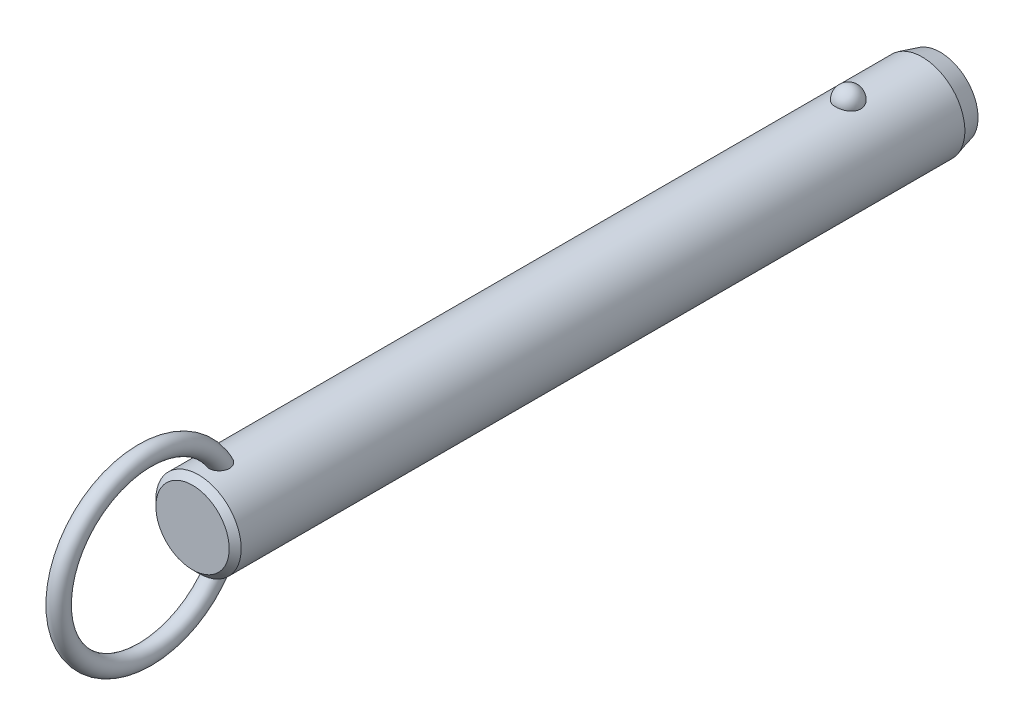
ISO-10303-21;
HEADER;
FILE_DESCRIPTION(('STEP AP214'),'2;1');
FILE_NAME('part.step','',(''),(''),'','','');
FILE_SCHEMA(('AUTOMOTIVE_DESIGN { 1 0 10303 214 1 1 1 1 }'));
ENDSEC;
DATA;
#1=APPLICATION_CONTEXT('core data for automotive mechanical design processes');
#2=APPLICATION_PROTOCOL_DEFINITION('international standard','automotive_design',2000,#1);
#3=PRODUCT_CONTEXT('',#1,'mechanical');
#4=PRODUCT('Part','Part','',(#3));
#5=PRODUCT_RELATED_PRODUCT_CATEGORY('part','',(#4));
#6=PRODUCT_DEFINITION_FORMATION('','',#4);
#7=PRODUCT_DEFINITION_CONTEXT('part definition',#1,'design');
#8=PRODUCT_DEFINITION('design','',#6,#7);
#9=PRODUCT_DEFINITION_SHAPE('','',#8);
#10=(LENGTH_UNIT() NAMED_UNIT(*) SI_UNIT(.MILLI.,.METRE.));
#11=(NAMED_UNIT(*) PLANE_ANGLE_UNIT() SI_UNIT($,.RADIAN.));
#12=(NAMED_UNIT(*) SI_UNIT($,.STERADIAN.) SOLID_ANGLE_UNIT());
#13=UNCERTAINTY_MEASURE_WITH_UNIT(LENGTH_MEASURE(1.E-05),#10,'distance_accuracy_value','');
#14=(GEOMETRIC_REPRESENTATION_CONTEXT(3) GLOBAL_UNCERTAINTY_ASSIGNED_CONTEXT((#13)) GLOBAL_UNIT_ASSIGNED_CONTEXT((#10,
#11,#12)) REPRESENTATION_CONTEXT('',''));
#15=CARTESIAN_POINT('',(0.,0.,0.));
#16=DIRECTION('',(0.,0.,1.));
#17=DIRECTION('',(1.,0.,0.));
#18=AXIS2_PLACEMENT_3D('',#15,#16,#17);
#19=CARTESIAN_POINT('',(0.,0.,99.1));
#20=DIRECTION('',(0.,0.,-1.));
#21=DIRECTION('',(-1.,0.,0.));
#22=AXIS2_PLACEMENT_3D('',#19,#20,#21);
#23=CYLINDRICAL_SURFACE('',#22,7.1);
#24=CARTESIAN_POINT('',(2.0769088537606,6.78943661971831,-2.1));
#25=CARTESIAN_POINT('',(2.07690739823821,6.78943796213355,-1.98268154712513));
#26=CARTESIAN_POINT('',(2.06738130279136,6.79237331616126,-1.86534506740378));
#27=CARTESIAN_POINT('',(2.0295040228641,6.8037853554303,-1.63400788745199));
#28=CARTESIAN_POINT('',(2.00114757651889,6.81226358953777,-1.52000812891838));
#29=CARTESIAN_POINT('',(1.92632025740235,6.83379798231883,-1.29863433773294));
#30=CARTESIAN_POINT('',(1.87985726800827,6.84685214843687,-1.19125744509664));
#31=CARTESIAN_POINT('',(1.76995205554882,6.87608091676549,-0.98604657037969));
#32=CARTESIAN_POINT('',(1.70650980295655,6.8922555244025,-0.88821260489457));
#33=CARTESIAN_POINT('',(1.5638119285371,6.92602930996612,-0.704242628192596));
#34=CARTESIAN_POINT('',(1.4844714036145,6.94363582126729,-0.618173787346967));
#35=CARTESIAN_POINT('',(1.31221746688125,6.97823658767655,-0.460740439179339));
#36=CARTESIAN_POINT('',(1.21930409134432,6.99523084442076,-0.389375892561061));
#37=CARTESIAN_POINT('',(1.02268781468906,7.02666176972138,-0.263547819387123));
#38=CARTESIAN_POINT('',(0.91902009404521,7.04110638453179,-0.209031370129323));
#39=CARTESIAN_POINT('',(0.703548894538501,7.06588726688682,-0.118163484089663));
#40=CARTESIAN_POINT('',(0.591746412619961,7.07622403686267,-0.0818098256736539));
#41=CARTESIAN_POINT('',(0.365557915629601,7.09147068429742,-0.0288711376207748));
#42=CARTESIAN_POINT('',(0.251267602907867,7.09648447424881,-0.0119070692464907));
#43=CARTESIAN_POINT('',(0.0213499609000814,7.10089837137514,0.00304925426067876));
#44=CARTESIAN_POINT('',(-0.0942772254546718,7.10029907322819,0.00104351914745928));
#45=CARTESIAN_POINT('',(-0.321651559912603,7.09360829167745,-0.0216931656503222));
#46=CARTESIAN_POINT('',(-0.433431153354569,7.08760388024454,-0.0421272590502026));
#47=CARTESIAN_POINT('',(-0.651862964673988,7.07086131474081,-0.100729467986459));
#48=CARTESIAN_POINT('',(-0.758515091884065,7.06012307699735,-0.138897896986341));
#49=CARTESIAN_POINT('',(-0.964449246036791,7.03496097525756,-0.232213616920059));
#50=CARTESIAN_POINT('',(-1.06368095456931,7.02051445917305,-0.287465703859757));
#51=CARTESIAN_POINT('',(-1.25145353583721,6.98948740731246,-0.413383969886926));
#52=CARTESIAN_POINT('',(-1.33999321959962,6.97290663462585,-0.48405186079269));
#53=CARTESIAN_POINT('',(-1.50591604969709,6.93898770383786,-0.640594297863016));
#54=CARTESIAN_POINT('',(-1.58302488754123,6.92164094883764,-0.726757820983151));
#55=CARTESIAN_POINT('',(-1.72189320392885,6.8884103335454,-0.91092752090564));
#56=CARTESIAN_POINT('',(-1.78365144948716,6.87252659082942,-1.008934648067));
#57=CARTESIAN_POINT('',(-1.89101272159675,6.84377189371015,-1.21549497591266));
#58=CARTESIAN_POINT('',(-1.93639553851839,6.83094274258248,-1.32416860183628));
#59=CARTESIAN_POINT('',(-2.00874275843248,6.81002070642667,-1.54791500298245));
#60=CARTESIAN_POINT('',(-2.03570774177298,6.80192767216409,-1.66298757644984));
#61=CARTESIAN_POINT('',(-2.07047276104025,6.7914266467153,-1.89571453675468));
#62=CARTESIAN_POINT('',(-2.07835878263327,6.78899315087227,-2.01335491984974));
#63=CARTESIAN_POINT('',(-2.07502083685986,6.79001409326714,-2.24833570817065));
#64=CARTESIAN_POINT('',(-2.06379746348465,6.7934683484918,-2.36567612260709));
#65=CARTESIAN_POINT('',(-2.02263913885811,6.80583442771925,-2.59603194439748));
#66=CARTESIAN_POINT('',(-1.99281127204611,6.81471501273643,-2.70906820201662));
#67=CARTESIAN_POINT('',(-1.91526639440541,6.83691232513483,-2.92836575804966));
#68=CARTESIAN_POINT('',(-1.8675486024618,6.85022924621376,-3.03462676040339));
#69=CARTESIAN_POINT('',(-1.75504492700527,6.87991336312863,-3.23806487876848));
#70=CARTESIAN_POINT('',(-1.69015924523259,6.89629822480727,-3.33518422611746));
#71=CARTESIAN_POINT('',(-1.54505404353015,6.93024852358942,-3.51697105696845));
#72=CARTESIAN_POINT('',(-1.46483385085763,6.94781401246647,-3.60163799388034));
#73=CARTESIAN_POINT('',(-1.29071406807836,6.98225977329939,-3.75654119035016));
#74=CARTESIAN_POINT('',(-1.19675650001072,6.99913673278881,-3.82671308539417));
#75=CARTESIAN_POINT('',(-0.997940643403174,7.03023618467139,-3.9501837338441));
#76=CARTESIAN_POINT('',(-0.89308318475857,7.04445887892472,-4.00348377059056));
#77=CARTESIAN_POINT('',(-0.676902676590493,7.06848365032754,-4.09107242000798));
#78=CARTESIAN_POINT('',(-0.565686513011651,7.0783430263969,-4.12560889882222));
#79=CARTESIAN_POINT('',(-0.338739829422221,7.09282534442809,-4.17575450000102));
#80=CARTESIAN_POINT('',(-0.223009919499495,7.09744899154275,-4.19136617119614));
#81=CARTESIAN_POINT('',(0.00707628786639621,7.10090930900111,-4.20307965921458));
#82=CARTESIAN_POINT('',(0.121410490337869,7.09986531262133,-4.19958377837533));
#83=CARTESIAN_POINT('',(0.347815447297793,7.092380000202,-4.17411564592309));
#84=CARTESIAN_POINT('',(0.459886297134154,7.08593891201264,-4.15214417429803));
#85=CARTESIAN_POINT('',(0.678084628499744,7.06838983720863,-4.09049562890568));
#86=CARTESIAN_POINT('',(0.784237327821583,7.05730369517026,-4.05090137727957));
#87=CARTESIAN_POINT('',(0.988305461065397,7.03163139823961,-3.95511447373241));
#88=CARTESIAN_POINT('',(1.08622031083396,7.01704499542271,-3.89892064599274));
#89=CARTESIAN_POINT('',(1.27284490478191,6.98562668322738,-3.77035541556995));
#90=CARTESIAN_POINT('',(1.36137372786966,6.96876135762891,-3.69772964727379));
#91=CARTESIAN_POINT('',(1.52509486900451,6.93477412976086,-3.53878279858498));
#92=CARTESIAN_POINT('',(1.60028496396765,6.91765218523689,-3.45245943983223));
#93=CARTESIAN_POINT('',(1.73681688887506,6.88465753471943,-3.26658774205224));
#94=CARTESIAN_POINT('',(1.79785966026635,6.86881574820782,-3.16681408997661));
#95=CARTESIAN_POINT('',(1.90265327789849,6.84053157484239,-2.95814408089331));
#96=CARTESIAN_POINT('',(1.94640861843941,6.82808830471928,-2.84925010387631));
#97=CARTESIAN_POINT('',(2.01274378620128,6.80881460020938,-2.63454318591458));
#98=CARTESIAN_POINT('',(2.03676193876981,6.80160856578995,-2.52920574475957));
#99=CARTESIAN_POINT('',(2.06884490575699,6.79191902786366,-2.3159172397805));
#100=CARTESIAN_POINT('',(2.07691019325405,6.78943538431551,-2.20796625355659));
#101=CARTESIAN_POINT('',(2.0769088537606,6.78943661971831,-2.1));
#102=B_SPLINE_CURVE_WITH_KNOTS('',3,(#24,#25,#26,#27,#28,#29,#30,#31,#32,#33,#34,#35,#36,#37,
#38,#39,#40,#41,#42,#43,#44,#45,#46,#47,#48,#49,#50,#51,#52,#53,#54,#55,#56,#57,#58,#59,#60,#61,
#62,#63,#64,#65,#66,#67,#68,#69,#70,#71,#72,#73,#74,#75,#76,#77,#78,#79,#80,#81,#82,#83,#84,#85,
#86,#87,#88,#89,#90,#91,#92,#93,#94,#95,#96,#97,#98,#99,#100,#101),.UNSPECIFIED.,.T.,.F.,(4,2,2,
2,2,2,2,2,2,2,2,2,2,2,2,2,2,2,2,2,2,2,2,2,2,2,2,2,2,2,2,2,2,2,2,2,2,2,4),(0.,0.351568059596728,
0.703234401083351,1.05474780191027,1.40626181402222,1.75970563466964,2.11314851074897,
2.4654696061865,2.81774759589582,3.16301449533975,3.50824481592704,3.84801136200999,
4.18778391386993,4.52968352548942,4.87162112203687,5.22076181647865,5.56993054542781,
5.92363364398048,6.27732559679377,6.62942052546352,6.98150450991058,7.33158042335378,
7.68167162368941,8.03384443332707,8.38603269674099,8.73975272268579,9.09344583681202,
9.44234545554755,9.79119807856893,10.1327344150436,10.4742563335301,10.8141898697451,
11.1541474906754,11.4997793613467,11.8454687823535,12.1979079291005,12.5502553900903,
12.8738073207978,13.1973496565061),.UNSPECIFIED.);
#103=CARTESIAN_POINT('',(2.0769088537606,6.78943661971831,-2.1));
#104=VERTEX_POINT('',#103);
#105=EDGE_CURVE('E41',#104,#104,#102,.T.);
#106=ORIENTED_EDGE('',*,*,#105,.T.);
#107=EDGE_LOOP('',(#106));
#108=FACE_BOUND('',#107,.T.);
#109=CARTESIAN_POINT('',(0.,0.,106.02));
#110=DIRECTION('',(0.,0.,1.));
#111=DIRECTION('',(1.,0.,0.));
#112=AXIS2_PLACEMENT_3D('',#109,#110,#111);
#113=CIRCLE('',#112,7.1);
#114=CARTESIAN_POINT('',(7.1,0.,106.02));
#115=VERTEX_POINT('',#114);
#116=EDGE_CURVE('E10',#115,#115,#113,.F.);
#117=ORIENTED_EDGE('',*,*,#116,.T.);
#118=EDGE_LOOP('',(#117));
#119=FACE_BOUND('',#118,.T.);
#120=CARTESIAN_POINT('',(-0.429539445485,-7.08699541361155,100.842921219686));
#121=CARTESIAN_POINT('',(-0.508331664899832,-7.08221999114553,100.866876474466));
#122=CARTESIAN_POINT('',(-0.58503984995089,-7.07624016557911,100.897457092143));
#123=CARTESIAN_POINT('',(-0.732082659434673,-7.06254296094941,100.971024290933));
#124=CARTESIAN_POINT('',(-0.802417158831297,-7.05482554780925,101.014011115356));
#125=CARTESIAN_POINT('',(-0.934722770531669,-7.03851844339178,101.111113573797));
#126=CARTESIAN_POINT('',(-0.99670020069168,-7.02992941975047,101.165220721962));
#127=CARTESIAN_POINT('',(-1.11079942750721,-7.01280697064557,101.282967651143));
#128=CARTESIAN_POINT('',(-1.16292136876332,-7.00427354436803,101.346607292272));
#129=CARTESIAN_POINT('',(-1.25705660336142,-6.98799959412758,101.482687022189));
#130=CARTESIAN_POINT('',(-1.2988803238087,-6.98027525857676,101.555259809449));
#131=CARTESIAN_POINT('',(-1.37069920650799,-6.96652886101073,101.706168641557));
#132=CARTESIAN_POINT('',(-1.40069157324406,-6.96050720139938,101.784506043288));
#133=CARTESIAN_POINT('',(-1.45043507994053,-6.95031881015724,101.950190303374));
#134=CARTESIAN_POINT('',(-1.46937115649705,-6.94630231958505,102.037789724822));
#135=CARTESIAN_POINT('',(-1.49424917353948,-6.94099239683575,102.214871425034));
#136=CARTESIAN_POINT('',(-1.50018601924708,-6.93970003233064,102.304354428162));
#137=CARTESIAN_POINT('',(-1.49978214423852,-6.93978815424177,102.494060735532));
#138=CARTESIAN_POINT('',(-1.49187639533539,-6.94150934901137,102.594279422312));
#139=CARTESIAN_POINT('',(-1.46177925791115,-6.94790814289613,102.792479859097));
#140=CARTESIAN_POINT('',(-1.43957541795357,-6.95258831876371,102.890459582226));
#141=CARTESIAN_POINT('',(-1.37783293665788,-6.96510647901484,103.09536292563));
#142=CARTESIAN_POINT('',(-1.33634073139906,-6.97328848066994,103.201680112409));
#143=CARTESIAN_POINT('',(-1.23686994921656,-6.99161706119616,103.406177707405));
#144=CARTESIAN_POINT('',(-1.17889192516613,-7.00176357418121,103.504358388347));
#145=CARTESIAN_POINT('',(-1.0587512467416,-7.02082898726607,103.672374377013));
#146=CARTESIAN_POINT('',(-0.999247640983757,-7.02963746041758,103.744123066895));
#147=CARTESIAN_POINT('',(-0.869494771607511,-7.04686074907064,103.877195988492));
#148=CARTESIAN_POINT('',(-0.799263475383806,-7.05527619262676,103.938537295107));
#149=CARTESIAN_POINT('',(-0.665408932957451,-7.06899457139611,104.035131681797));
#150=CARTESIAN_POINT('',(-0.603817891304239,-7.07457275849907,104.073151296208));
#151=CARTESIAN_POINT('',(-0.475172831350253,-7.08437420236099,104.138758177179));
#152=CARTESIAN_POINT('',(-0.408123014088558,-7.08859848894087,104.166353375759));
#153=CARTESIAN_POINT('',(-0.269431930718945,-7.09522749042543,104.209256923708));
#154=CARTESIAN_POINT('',(-0.197757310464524,-7.09761688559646,104.224461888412));
#155=CARTESIAN_POINT('',(-0.0527849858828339,-7.10017268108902,104.240716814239));
#156=CARTESIAN_POINT('',(0.0205115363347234,-7.10034065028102,104.241776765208));
#157=CARTESIAN_POINT('',(0.156426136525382,-7.09855986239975,104.230461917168));
#158=CARTESIAN_POINT('',(0.219199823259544,-7.09688191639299,104.219806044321));
#159=CARTESIAN_POINT('',(0.342134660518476,-7.09201880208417,104.188537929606));
#160=CARTESIAN_POINT('',(0.402295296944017,-7.08883333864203,104.167923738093));
#161=CARTESIAN_POINT('',(0.520687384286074,-7.08113868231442,104.117212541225));
#162=CARTESIAN_POINT('',(0.578791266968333,-7.07658958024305,104.086827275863));
#163=CARTESIAN_POINT('',(0.690173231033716,-7.06659708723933,104.018367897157));
#164=CARTESIAN_POINT('',(0.743447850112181,-7.061153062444,103.980288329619));
#165=CARTESIAN_POINT('',(0.870947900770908,-7.04680292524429,103.876592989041));
#166=CARTESIAN_POINT('',(0.941828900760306,-7.0375580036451,103.806897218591));
#167=CARTESIAN_POINT('',(1.07136606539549,-7.01900793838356,103.656945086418));
#168=CARTESIAN_POINT('',(1.13000013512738,-7.00970271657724,103.576670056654));
#169=CARTESIAN_POINT('',(1.23579584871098,-6.99183327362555,103.406899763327));
#170=CARTESIAN_POINT('',(1.2827427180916,-6.98328455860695,103.317269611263));
#171=CARTESIAN_POINT('',(1.36351442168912,-6.96796352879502,103.132176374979));
#172=CARTESIAN_POINT('',(1.39733971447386,-6.96119115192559,103.036713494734));
#173=CARTESIAN_POINT('',(1.45579181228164,-6.94922464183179,102.82530928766));
#174=CARTESIAN_POINT('',(1.47790145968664,-6.94449000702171,102.708631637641));
#175=CARTESIAN_POINT('',(1.50168752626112,-6.93938731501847,102.473015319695));
#176=CARTESIAN_POINT('',(1.50336085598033,-6.93901991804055,102.35407631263));
#177=CARTESIAN_POINT('',(1.48486516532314,-6.9430010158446,102.12360799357));
#178=CARTESIAN_POINT('',(1.46573441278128,-6.9471253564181,102.011995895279));
#179=CARTESIAN_POINT('',(1.40606892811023,-6.95944667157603,101.794886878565));
#180=CARTESIAN_POINT('',(1.36556446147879,-6.96763788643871,101.6893815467));
#181=CARTESIAN_POINT('',(1.27082700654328,-6.98548038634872,101.504287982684));
#182=CARTESIAN_POINT('',(1.21949810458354,-6.99473841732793,101.423171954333));
#183=CARTESIAN_POINT('',(1.10242050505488,-7.01414069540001,101.272227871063));
#184=CARTESIAN_POINT('',(1.03668119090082,-7.02428436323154,101.20239252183));
#185=CARTESIAN_POINT('',(0.900559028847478,-7.04295285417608,101.083573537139));
#186=CARTESIAN_POINT('',(0.83142884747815,-7.05153466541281,101.033157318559));
#187=CARTESIAN_POINT('',(0.68529187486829,-7.06723150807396,100.945142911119));
#188=CARTESIAN_POINT('',(0.608287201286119,-7.0743469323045,100.907541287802));
#189=CARTESIAN_POINT('',(0.451878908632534,-7.08602232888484,100.847491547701));
#190=CARTESIAN_POINT('',(0.372686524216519,-7.09067127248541,100.824508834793));
#191=CARTESIAN_POINT('',(0.211477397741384,-7.09730788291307,100.792035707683));
#192=CARTESIAN_POINT('',(0.129460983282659,-7.09929585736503,100.78254373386));
#193=CARTESIAN_POINT('',(-0.0332905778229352,-7.10037858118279,100.777351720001));
#194=CARTESIAN_POINT('',(-0.11401636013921,-7.09953334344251,100.781365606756));
#195=CARTESIAN_POINT('',(-0.273670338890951,-7.09517338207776,100.802454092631));
#196=CARTESIAN_POINT('',(-0.352598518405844,-7.09165863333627,100.819528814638));
#197=CARTESIAN_POINT('',(-0.429539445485,-7.08699541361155,100.842921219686));
#198=B_SPLINE_CURVE_WITH_KNOTS('',3,(#120,#121,#122,#123,#124,#125,#126,#127,#128,#129,#130,
#131,#132,#133,#134,#135,#136,#137,#138,#139,#140,#141,#142,#143,#144,#145,#146,#147,#148,#149,
#150,#151,#152,#153,#154,#155,#156,#157,#158,#159,#160,#161,#162,#163,#164,#165,#166,#167,#168,
#169,#170,#171,#172,#173,#174,#175,#176,#177,#178,#179,#180,#181,#182,#183,#184,#185,#186,#187,
#188,#189,#190,#191,#192,#193,#194,#195,#196,#197),.UNSPECIFIED.,.T.,.F.,(4,2,2,2,2,2,2,2,2,2,2,
2,2,2,2,2,2,2,2,2,2,2,2,2,2,2,2,2,2,2,2,2,2,2,2,2,2,2,4),(0.,0.247183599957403,
0.494372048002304,0.741372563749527,0.988369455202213,1.23962059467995,1.49093106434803,
1.75897818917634,2.02713035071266,2.3275826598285,2.62829697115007,2.97008736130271,
3.31186629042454,3.59175319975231,3.87117637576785,4.08813841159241,4.30493502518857,
4.52352259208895,4.74195577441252,4.9321532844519,5.12238804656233,5.31884850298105,
5.51544871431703,5.81332317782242,6.11173048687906,6.4152726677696,6.71880423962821,
7.07358156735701,7.42841252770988,7.76631485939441,8.10373999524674,8.39142246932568,
8.67891817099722,8.93560332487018,9.19221962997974,9.43881106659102,9.68537399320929,
9.92674752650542,10.1681233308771),.UNSPECIFIED.);
#199=CARTESIAN_POINT('',(-0.429539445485,-7.08699541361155,100.842921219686));
#200=VERTEX_POINT('',#199);
#201=EDGE_CURVE('E60',#200,#200,#198,.T.);
#202=ORIENTED_EDGE('',*,*,#201,.T.);
#203=EDGE_LOOP('',(#202));
#204=FACE_BOUND('',#203,.T.);
#205=CARTESIAN_POINT('',(-0.429539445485,7.08699541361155,100.842921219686));
#206=CARTESIAN_POINT('',(-0.351665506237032,7.09171429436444,100.819246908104));
#207=CARTESIAN_POINT('',(-0.271733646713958,7.09525896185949,100.802036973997));
#208=CARTESIAN_POINT('',(-0.110026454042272,7.09960839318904,100.781005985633));
#209=CARTESIAN_POINT('',(-0.0282502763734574,7.10041187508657,100.777191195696));
#210=CARTESIAN_POINT('',(0.134782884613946,7.09918849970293,100.783059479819));
#211=CARTESIAN_POINT('',(0.216039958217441,7.09716214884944,100.79274013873));
#212=CARTESIAN_POINT('',(0.375730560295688,7.09050177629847,100.825347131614));
#213=CARTESIAN_POINT('',(0.454164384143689,7.08586802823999,100.848272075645));
#214=CARTESIAN_POINT('',(0.606025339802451,7.07449911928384,100.906771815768));
#215=CARTESIAN_POINT('',(0.679451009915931,7.06776334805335,100.942350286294));
#216=CARTESIAN_POINT('',(0.819234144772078,7.05292866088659,101.025175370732));
#217=CARTESIAN_POINT('',(0.88559181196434,7.04482978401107,101.072421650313));
#218=CARTESIAN_POINT('',(1.00993211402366,7.02808709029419,101.177590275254));
#219=CARTESIAN_POINT('',(1.06785399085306,7.01943990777,101.235583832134));
#220=CARTESIAN_POINT('',(1.17342527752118,7.00256662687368,101.360301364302));
#221=CARTESIAN_POINT('',(1.22107408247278,6.99434055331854,101.427025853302));
#222=CARTESIAN_POINT('',(1.30652927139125,6.97889183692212,101.569362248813));
#223=CARTESIAN_POINT('',(1.34399711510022,6.97170674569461,101.645180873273));
#224=CARTESIAN_POINT('',(1.40682616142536,6.95930080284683,101.801810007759));
#225=CARTESIAN_POINT('',(1.43218374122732,6.95408053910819,101.88262200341));
#226=CARTESIAN_POINT('',(1.47246409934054,6.94566853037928,102.053531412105));
#227=CARTESIAN_POINT('',(1.48642590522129,6.9426653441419,102.14386307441));
#228=CARTESIAN_POINT('',(1.5011410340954,6.93949744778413,102.325619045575));
#229=CARTESIAN_POINT('',(1.50188917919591,6.93933385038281,102.417043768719));
#230=CARTESIAN_POINT('',(1.49030464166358,6.94183245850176,102.61084381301));
#231=CARTESIAN_POINT('',(1.47627413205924,6.94486147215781,102.713112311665));
#232=CARTESIAN_POINT('',(1.43356351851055,6.95380194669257,102.914471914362));
#233=CARTESIAN_POINT('',(1.4048676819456,6.95971650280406,103.013559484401));
#234=CARTESIAN_POINT('',(1.32908750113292,6.97461208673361,103.218908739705));
#235=CARTESIAN_POINT('',(1.28011435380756,6.98388945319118,103.324456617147));
#236=CARTESIAN_POINT('',(1.16520357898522,7.00397743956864,103.525760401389));
#237=CARTESIAN_POINT('',(1.09927694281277,7.01478706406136,103.621522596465));
#238=CARTESIAN_POINT('',(0.969361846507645,7.03373936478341,103.776756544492));
#239=CARTESIAN_POINT('',(0.909042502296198,7.04187023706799,103.839303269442));
#240=CARTESIAN_POINT('',(0.77917855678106,7.0574173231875,103.954053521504));
#241=CARTESIAN_POINT('',(0.70964977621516,7.06483472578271,104.006274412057));
#242=CARTESIAN_POINT('',(0.576854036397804,7.0767751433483,104.088113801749));
#243=CARTESIAN_POINT('',(0.515118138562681,7.08158033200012,104.120164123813));
#244=CARTESIAN_POINT('',(0.387127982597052,7.08972701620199,104.173765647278));
#245=CARTESIAN_POINT('',(0.320877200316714,7.09306962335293,104.195324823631));
#246=CARTESIAN_POINT('',(0.185041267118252,7.09791507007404,104.226400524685));
#247=CARTESIAN_POINT('',(0.115437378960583,7.09940591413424,104.235838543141));
#248=CARTESIAN_POINT('',(-0.0243157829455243,7.10030171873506,104.241522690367));
#249=CARTESIAN_POINT('',(-0.0944648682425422,7.0997073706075,104.237773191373));
#250=CARTESIAN_POINT('',(-0.225713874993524,7.09668414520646,104.218508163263));
#251=CARTESIAN_POINT('',(-0.287006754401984,7.09444865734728,104.204232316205));
#252=CARTESIAN_POINT('',(-0.40655537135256,7.08860360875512,104.166368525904));
#253=CARTESIAN_POINT('',(-0.46480981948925,7.08499346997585,104.142776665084));
#254=CARTESIAN_POINT('',(-0.594955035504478,7.07541654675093,104.078923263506));
#255=CARTESIAN_POINT('',(-0.665389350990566,7.06906574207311,104.035753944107));
#256=CARTESIAN_POINT('',(-0.798242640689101,7.05530261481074,103.938587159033));
#257=CARTESIAN_POINT('',(-0.860645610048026,7.0478882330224,103.884568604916));
#258=CARTESIAN_POINT('',(-0.994249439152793,7.03045217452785,103.750996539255));
#259=CARTESIAN_POINT('',(-1.06260129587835,7.02030745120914,103.668614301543));
#260=CARTESIAN_POINT('',(-1.18502045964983,7.00068382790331,103.493843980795));
#261=CARTESIAN_POINT('',(-1.23907684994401,6.99120544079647,103.401448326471));
#262=CARTESIAN_POINT('',(-1.33335589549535,6.97384343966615,103.208008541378));
#263=CARTESIAN_POINT('',(-1.37336138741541,6.96598557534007,103.106856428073));
#264=CARTESIAN_POINT('',(-1.43770677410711,6.9529905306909,102.899504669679));
#265=CARTESIAN_POINT('',(-1.46204473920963,6.94785368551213,102.79330440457));
#266=CARTESIAN_POINT('',(-1.49537533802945,6.94076296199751,102.568231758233));
#267=CARTESIAN_POINT('',(-1.50273564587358,6.93914842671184,102.44909751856));
#268=CARTESIAN_POINT('',(-1.4954555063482,6.94072368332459,102.211470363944));
#269=CARTESIAN_POINT('',(-1.48082914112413,6.94391040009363,102.092977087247));
#270=CARTESIAN_POINT('',(-1.43076401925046,6.95438579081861,101.873432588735));
#271=CARTESIAN_POINT('',(-1.39762227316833,6.96121852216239,101.771841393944));
#272=CARTESIAN_POINT('',(-1.31211274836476,6.97783941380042,101.577351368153));
#273=CARTESIAN_POINT('',(-1.2597660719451,6.98762432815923,101.48444313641));
#274=CARTESIAN_POINT('',(-1.14583073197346,7.00713153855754,101.324160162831));
#275=CARTESIAN_POINT('',(-1.0866594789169,7.01665982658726,101.255035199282));
#276=CARTESIAN_POINT('',(-0.956606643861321,7.03556646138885,101.128878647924));
#277=CARTESIAN_POINT('',(-0.88573712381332,7.04494495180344,101.071834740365));
#278=CARTESIAN_POINT('',(-0.75155804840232,7.06035735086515,100.983100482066));
#279=CARTESIAN_POINT('',(-0.690120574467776,7.0666695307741,100.948593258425));
#280=CARTESIAN_POINT('',(-0.562815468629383,7.07794609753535,100.888750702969));
#281=CARTESIAN_POINT('',(-0.496948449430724,7.08291067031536,100.863414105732));
#282=CARTESIAN_POINT('',(-0.429539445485,7.08699541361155,100.842921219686));
#283=B_SPLINE_CURVE_WITH_KNOTS('',3,(#205,#206,#207,#208,#209,#210,#211,#212,#213,#214,#215,
#216,#217,#218,#219,#220,#221,#222,#223,#224,#225,#226,#227,#228,#229,#230,#231,#232,#233,#234,
#235,#236,#237,#238,#239,#240,#241,#242,#243,#244,#245,#246,#247,#248,#249,#250,#251,#252,#253,
#254,#255,#256,#257,#258,#259,#260,#261,#262,#263,#264,#265,#266,#267,#268,#269,#270,#271,#272,
#273,#274,#275,#276,#277,#278,#279,#280,#281,#282),.UNSPECIFIED.,.T.,.F.,(4,2,2,2,2,2,2,2,2,2,2,
2,2,2,2,2,2,2,2,2,2,2,2,2,2,2,2,2,2,2,2,2,2,2,2,2,2,2,4),(0.,0.244335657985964,
0.488785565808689,0.73319173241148,0.977572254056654,1.22202379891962,1.46646834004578,
1.71259457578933,1.95873529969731,2.21226768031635,2.46587585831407,2.7391381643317,
3.01250754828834,3.32109936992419,3.63002293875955,3.97863512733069,4.32702187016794,
4.5879394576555,4.84841449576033,5.05676704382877,5.26496096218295,5.47449661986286,
5.68396281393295,5.8720544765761,6.06022532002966,6.30743751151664,6.55513496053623,
6.87602468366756,7.19715875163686,7.52305774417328,7.84899686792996,8.20516155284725,
8.56109821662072,8.8804008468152,9.19935367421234,9.47236282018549,9.74509220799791,
9.9566225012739,10.1681235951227),.UNSPECIFIED.);
#284=CARTESIAN_POINT('',(-0.429539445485,7.08699541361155,100.842921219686));
#285=VERTEX_POINT('',#284);
#286=EDGE_CURVE('E68',#285,#285,#283,.T.);
#287=ORIENTED_EDGE('',*,*,#286,.T.);
#288=EDGE_LOOP('',(#287));
#289=FACE_BOUND('',#288,.T.);
#290=CARTESIAN_POINT('',(0.,0.,-14.4));
#291=DIRECTION('',(0.,0.,-1.));
#292=DIRECTION('',(-1.,0.,0.));
#293=AXIS2_PLACEMENT_3D('',#290,#291,#292);
#294=CIRCLE('',#293,7.1);
#295=CARTESIAN_POINT('',(-7.1,0.,-14.4));
#296=VERTEX_POINT('',#295);
#297=EDGE_CURVE('E57',#296,#296,#294,.F.);
#298=ORIENTED_EDGE('',*,*,#297,.T.);
#299=EDGE_LOOP('',(#298));
#300=FACE_BOUND('',#299,.T.);
#301=ADVANCED_FACE('F37',(#108,#119,#204,#289,#300),#23,.T.);
#302=CARTESIAN_POINT('',(0.,0.,-17.4));
#303=DIRECTION('',(0.,0.,-1.));
#304=DIRECTION('',(-1.,0.,0.));
#305=AXIS2_PLACEMENT_3D('',#302,#303,#304);
#306=PLANE('',#305);
#307=CARTESIAN_POINT('',(0.,0.,-17.4));
#308=DIRECTION('',(0.,0.,-1.));
#309=DIRECTION('',(-1.,0.,0.));
#310=AXIS2_PLACEMENT_3D('',#307,#308,#309);
#311=CIRCLE('',#310,6.29615242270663);
#312=CARTESIAN_POINT('',(-6.29615242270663,0.,-17.4));
#313=VERTEX_POINT('',#312);
#314=EDGE_CURVE('E67',#313,#313,#311,.T.);
#315=ORIENTED_EDGE('',*,*,#314,.T.);
#316=EDGE_LOOP('',(#315));
#317=FACE_BOUND('',#316,.T.);
#318=ADVANCED_FACE('F86',(#317),#306,.T.);
#319=CARTESIAN_POINT('',(0.,0.,-17.4));
#320=DIRECTION('',(0.,0.,1.));
#321=DIRECTION('',(1.,0.,0.));
#322=AXIS2_PLACEMENT_3D('',#319,#320,#321);
#323=CONICAL_SURFACE('',#322,6.29615242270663,0.261799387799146);
#324=ORIENTED_EDGE('',*,*,#297,.F.);
#325=EDGE_LOOP('',(#324));
#326=FACE_BOUND('',#325,.T.);
#327=ORIENTED_EDGE('',*,*,#314,.F.);
#328=EDGE_LOOP('',(#327));
#329=FACE_BOUND('',#328,.T.);
#330=ADVANCED_FACE('F84',(#326,#329),#323,.T.);
#331=CARTESIAN_POINT('',(0.,0.,107.02));
#332=DIRECTION('',(0.,0.,1.));
#333=DIRECTION('',(1.,0.,0.));
#334=AXIS2_PLACEMENT_3D('',#331,#332,#333);
#335=PLANE('',#334);
#336=CARTESIAN_POINT('',(0.,0.,107.02));
#337=DIRECTION('',(0.,0.,1.));
#338=DIRECTION('',(1.,0.,0.));
#339=AXIS2_PLACEMENT_3D('',#336,#337,#338);
#340=CIRCLE('',#339,6.10000000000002);
#341=CARTESIAN_POINT('',(6.10000000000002,0.,107.02));
#342=VERTEX_POINT('',#341);
#343=EDGE_CURVE('E50',#342,#342,#340,.T.);
#344=ORIENTED_EDGE('',*,*,#343,.T.);
#345=EDGE_LOOP('',(#344));
#346=FACE_BOUND('',#345,.T.);
#347=ADVANCED_FACE('F78',(#346),#335,.T.);
#348=CARTESIAN_POINT('',(0.,0.,114.95));
#349=DIRECTION('',(1.,0.,0.));
#350=DIRECTION('',(0.,0.,-1.));
#351=AXIS2_PLACEMENT_3D('',#348,#349,#350);
#352=TOROIDAL_SURFACE('',#351,14.35,1.5);
#353=ORIENTED_EDGE('',*,*,#286,.F.);
#354=EDGE_LOOP('',(#353));
#355=FACE_BOUND('',#354,.T.);
#356=ORIENTED_EDGE('',*,*,#201,.F.);
#357=EDGE_LOOP('',(#356));
#358=FACE_BOUND('',#357,.T.);
#359=ADVANCED_FACE('F74',(#355,#358),#352,.T.);
#360=CARTESIAN_POINT('',(0.,0.,107.02));
#361=DIRECTION('',(0.,0.,-1.));
#362=DIRECTION('',(-1.,0.,0.));
#363=AXIS2_PLACEMENT_3D('',#360,#361,#362);
#364=CONICAL_SURFACE('',#363,6.10000000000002,0.785398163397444);
#365=ORIENTED_EDGE('',*,*,#116,.F.);
#366=EDGE_LOOP('',(#365));
#367=FACE_BOUND('',#366,.T.);
#368=ORIENTED_EDGE('',*,*,#343,.F.);
#369=EDGE_LOOP('',(#368));
#370=FACE_BOUND('',#369,.T.);
#371=ADVANCED_FACE('F39',(#367,#370),#364,.T.);
#372=CARTESIAN_POINT('',(0.,7.1,-2.1));
#373=DIRECTION('',(0.,1.,0.));
#374=DIRECTION('',(0.,0.,1.));
#375=AXIS2_PLACEMENT_3D('',#372,#373,#374);
#376=SPHERICAL_SURFACE('',#375,2.10000000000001);
#377=ORIENTED_EDGE('',*,*,#105,.F.);
#378=EDGE_LOOP('',(#377));
#379=FACE_BOUND('',#378,.T.);
#380=ADVANCED_FACE('F80',(#379),#376,.T.);
#381=CLOSED_SHELL('',(#301,#318,#330,#347,#359,#371,#380));
#382=MANIFOLD_SOLID_BREP('B2',#381);
#383=ADVANCED_BREP_SHAPE_REPRESENTATION('',(#18,#382),#14);
#384=SHAPE_DEFINITION_REPRESENTATION(#9,#383);
ENDSEC;
END-ISO-10303-21;
